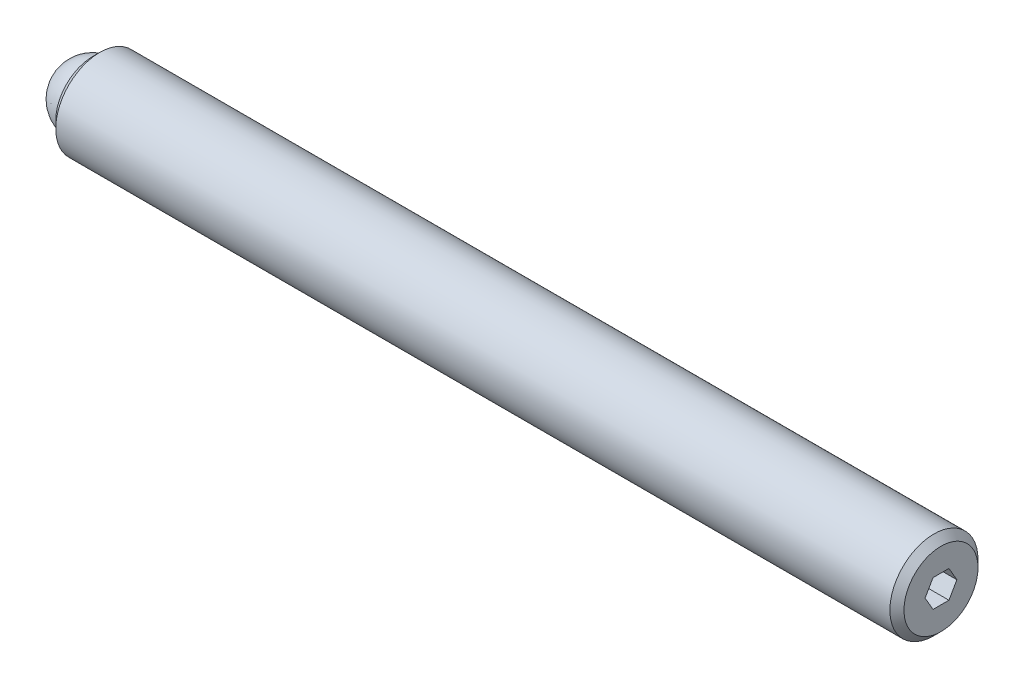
ISO-10303-21;
HEADER;
FILE_DESCRIPTION(('STEP AP214'),'2;1');
FILE_NAME('part.step','',(''),(''),'','','');
FILE_SCHEMA(('AUTOMOTIVE_DESIGN { 1 0 10303 214 1 1 1 1 }'));
ENDSEC;
DATA;
#1=APPLICATION_CONTEXT('core data for automotive mechanical design processes');
#2=APPLICATION_PROTOCOL_DEFINITION('international standard','automotive_design',2000,#1);
#3=PRODUCT_CONTEXT('',#1,'mechanical');
#4=PRODUCT('Part','Part','',(#3));
#5=PRODUCT_RELATED_PRODUCT_CATEGORY('part','',(#4));
#6=PRODUCT_DEFINITION_FORMATION('','',#4);
#7=PRODUCT_DEFINITION_CONTEXT('part definition',#1,'design');
#8=PRODUCT_DEFINITION('design','',#6,#7);
#9=PRODUCT_DEFINITION_SHAPE('','',#8);
#10=(LENGTH_UNIT() NAMED_UNIT(*) SI_UNIT(.MILLI.,.METRE.));
#11=(NAMED_UNIT(*) PLANE_ANGLE_UNIT() SI_UNIT($,.RADIAN.));
#12=(NAMED_UNIT(*) SI_UNIT($,.STERADIAN.) SOLID_ANGLE_UNIT());
#13=UNCERTAINTY_MEASURE_WITH_UNIT(LENGTH_MEASURE(1.E-05),#10,'distance_accuracy_value','');
#14=(GEOMETRIC_REPRESENTATION_CONTEXT(3) GLOBAL_UNCERTAINTY_ASSIGNED_CONTEXT((#13)) GLOBAL_UNIT_ASSIGNED_CONTEXT((#10,
#11,#12)) REPRESENTATION_CONTEXT('',''));
#15=CARTESIAN_POINT('',(0.,0.,0.));
#16=DIRECTION('',(0.,0.,1.));
#17=DIRECTION('',(1.,0.,0.));
#18=AXIS2_PLACEMENT_3D('',#15,#16,#17);
#19=CARTESIAN_POINT('',(0.,0.,0.));
#20=DIRECTION('',(0.,-1.,0.));
#21=DIRECTION('',(0.,0.,1.));
#22=AXIS2_PLACEMENT_3D('',#19,#20,#21);
#23=SPHERICAL_SURFACE('',#22,2.38125);
#24=CARTESIAN_POINT('',(0.,-2.38125,0.));
#25=VERTEX_POINT('',#24);
#26=VERTEX_LOOP('',#25);
#27=FACE_BOUND('',#26,.T.);
#28=ADVANCED_FACE('F43',(#27),#23,.T.);
#29=CLOSED_SHELL('',(#28));
#30=MANIFOLD_SOLID_BREP('B2',#29);
#31=CARTESIAN_POINT('',(61.11875,0.,0.));
#32=DIRECTION('',(-1.,0.,0.));
#33=DIRECTION('',(0.,0.,1.));
#34=AXIS2_PLACEMENT_3D('',#31,#32,#33);
#35=CYLINDRICAL_SURFACE('',#34,3.175);
#36=CARTESIAN_POINT('',(60.61075,0.,0.));
#37=DIRECTION('',(1.,0.,0.));
#38=DIRECTION('',(0.,0.,-1.));
#39=AXIS2_PLACEMENT_3D('',#36,#37,#38);
#40=CIRCLE('',#39,3.175);
#41=CARTESIAN_POINT('',(60.61075,0.,-3.175));
#42=VERTEX_POINT('',#41);
#43=EDGE_CURVE('E41',#42,#42,#40,.F.);
#44=ORIENTED_EDGE('',*,*,#43,.T.);
#45=EDGE_LOOP('',(#44));
#46=FACE_BOUND('',#45,.T.);
#47=CARTESIAN_POINT('',(0.508000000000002,0.,0.));
#48=DIRECTION('',(1.,0.,0.));
#49=DIRECTION('',(0.,0.,-1.));
#50=AXIS2_PLACEMENT_3D('',#47,#48,#49);
#51=CIRCLE('',#50,3.175);
#52=CARTESIAN_POINT('',(0.508000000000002,0.,-3.175));
#53=VERTEX_POINT('',#52);
#54=EDGE_CURVE('E159',#53,#53,#51,.T.);
#55=ORIENTED_EDGE('',*,*,#54,.T.);
#56=EDGE_LOOP('',(#55));
#57=FACE_BOUND('',#56,.T.);
#58=ADVANCED_FACE('F56',(#46,#57),#35,.T.);
#59=CARTESIAN_POINT('',(61.11875,0.,0.));
#60=DIRECTION('',(1.,0.,0.));
#61=DIRECTION('',(0.,0.,-1.));
#62=AXIS2_PLACEMENT_3D('',#59,#60,#61);
#63=PLANE('',#62);
#64=DIRECTION('',(0.,0.866025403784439,-0.5));
#65=VECTOR('',#64,1.);
#66=CARTESIAN_POINT('',(61.11875,-0.9921875,-0.572839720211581));
#67=LINE('',#66,#65);
#68=CARTESIAN_POINT('',(61.11875,-0.9921875,-0.572839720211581));
#69=VERTEX_POINT('',#68);
#70=CARTESIAN_POINT('',(61.11875,0.,-1.14567944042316));
#71=VERTEX_POINT('',#70);
#72=EDGE_CURVE('E71',#69,#71,#67,.T.);
#73=ORIENTED_EDGE('',*,*,#72,.F.);
#74=DIRECTION('',(0.,0.,-1.));
#75=VECTOR('',#74,1.);
#76=CARTESIAN_POINT('',(61.11875,-0.9921875,0.572839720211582));
#77=LINE('',#76,#75);
#78=CARTESIAN_POINT('',(61.11875,-0.9921875,0.572839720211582));
#79=VERTEX_POINT('',#78);
#80=EDGE_CURVE('E155',#79,#69,#77,.T.);
#81=ORIENTED_EDGE('',*,*,#80,.F.);
#82=DIRECTION('',(0.,-0.866025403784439,-0.5));
#83=VECTOR('',#82,1.);
#84=CARTESIAN_POINT('',(61.11875,0.,1.14567944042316));
#85=LINE('',#84,#83);
#86=CARTESIAN_POINT('',(61.11875,0.,1.14567944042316));
#87=VERTEX_POINT('',#86);
#88=EDGE_CURVE('E153',#87,#79,#85,.T.);
#89=ORIENTED_EDGE('',*,*,#88,.F.);
#90=DIRECTION('',(0.,-0.866025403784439,0.5));
#91=VECTOR('',#90,1.);
#92=CARTESIAN_POINT('',(61.11875,0.992187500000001,0.572839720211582));
#93=LINE('',#92,#91);
#94=CARTESIAN_POINT('',(61.11875,0.992187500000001,0.572839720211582));
#95=VERTEX_POINT('',#94);
#96=EDGE_CURVE('E119',#95,#87,#93,.T.);
#97=ORIENTED_EDGE('',*,*,#96,.F.);
#98=DIRECTION('',(0.,0.,1.));
#99=VECTOR('',#98,1.);
#100=CARTESIAN_POINT('',(61.11875,0.9921875,-0.572839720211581));
#101=LINE('',#100,#99);
#102=CARTESIAN_POINT('',(61.11875,0.9921875,-0.572839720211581));
#103=VERTEX_POINT('',#102);
#104=EDGE_CURVE('E149',#103,#95,#101,.T.);
#105=ORIENTED_EDGE('',*,*,#104,.F.);
#106=DIRECTION('',(0.,0.866025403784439,0.5));
#107=VECTOR('',#106,1.);
#108=CARTESIAN_POINT('',(61.11875,0.,-1.14567944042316));
#109=LINE('',#108,#107);
#110=EDGE_CURVE('E145',#71,#103,#109,.T.);
#111=ORIENTED_EDGE('',*,*,#110,.F.);
#112=EDGE_LOOP('',(#73,#81,#89,#97,#105,#111));
#113=FACE_BOUND('',#112,.T.);
#114=CARTESIAN_POINT('',(61.11875,0.,0.));
#115=DIRECTION('',(1.,0.,0.));
#116=DIRECTION('',(0.,0.,-1.));
#117=AXIS2_PLACEMENT_3D('',#114,#115,#116);
#118=CIRCLE('',#117,2.667);
#119=CARTESIAN_POINT('',(61.11875,0.,-2.667));
#120=VERTEX_POINT('',#119);
#121=EDGE_CURVE('E64',#120,#120,#118,.T.);
#122=ORIENTED_EDGE('',*,*,#121,.T.);
#123=EDGE_LOOP('',(#122));
#124=FACE_BOUND('',#123,.T.);
#125=ADVANCED_FACE('F172',(#113,#124),#63,.T.);
#126=CARTESIAN_POINT('',(0.,0.,0.));
#127=DIRECTION('',(1.,0.,0.));
#128=DIRECTION('',(0.,0.,-1.));
#129=AXIS2_PLACEMENT_3D('',#126,#127,#128);
#130=PLANE('',#129);
#131=CARTESIAN_POINT('',(0.,0.,0.));
#132=DIRECTION('',(-1.,0.,0.));
#133=DIRECTION('',(0.,0.,1.));
#134=AXIS2_PLACEMENT_3D('',#131,#132,#133);
#135=CIRCLE('',#134,2.38125);
#136=CARTESIAN_POINT('',(0.,0.,2.38125));
#137=VERTEX_POINT('',#136);
#138=EDGE_CURVE('E227',#137,#137,#135,.T.);
#139=ORIENTED_EDGE('',*,*,#138,.F.);
#140=EDGE_LOOP('',(#139));
#141=FACE_BOUND('',#140,.T.);
#142=CARTESIAN_POINT('',(0.,0.,0.));
#143=DIRECTION('',(1.,0.,0.));
#144=DIRECTION('',(0.,0.,-1.));
#145=AXIS2_PLACEMENT_3D('',#142,#143,#144);
#146=CIRCLE('',#145,2.667);
#147=CARTESIAN_POINT('',(0.,0.,-2.667));
#148=VERTEX_POINT('',#147);
#149=EDGE_CURVE('E167',#148,#148,#146,.F.);
#150=ORIENTED_EDGE('',*,*,#149,.T.);
#151=EDGE_LOOP('',(#150));
#152=FACE_BOUND('',#151,.T.);
#153=ADVANCED_FACE('F184',(#141,#152),#130,.F.);
#154=CARTESIAN_POINT('',(0.508000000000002,0.,0.));
#155=DIRECTION('',(1.,0.,0.));
#156=DIRECTION('',(0.,0.,-1.));
#157=AXIS2_PLACEMENT_3D('',#154,#155,#156);
#158=CONICAL_SURFACE('',#157,3.175,0.78539816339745);
#159=ORIENTED_EDGE('',*,*,#149,.F.);
#160=EDGE_LOOP('',(#159));
#161=FACE_BOUND('',#160,.T.);
#162=ORIENTED_EDGE('',*,*,#54,.F.);
#163=EDGE_LOOP('',(#162));
#164=FACE_BOUND('',#163,.T.);
#165=ADVANCED_FACE('F176',(#161,#164),#158,.T.);
#166=CARTESIAN_POINT('',(61.11875,0.,0.));
#167=DIRECTION('',(-1.,0.,0.));
#168=DIRECTION('',(0.,0.,1.));
#169=AXIS2_PLACEMENT_3D('',#166,#167,#168);
#170=CONICAL_SURFACE('',#169,2.667,0.785398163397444);
#171=ORIENTED_EDGE('',*,*,#43,.F.);
#172=EDGE_LOOP('',(#171));
#173=FACE_BOUND('',#172,.T.);
#174=ORIENTED_EDGE('',*,*,#121,.F.);
#175=EDGE_LOOP('',(#174));
#176=FACE_BOUND('',#175,.T.);
#177=ADVANCED_FACE('F58',(#173,#176),#170,.T.);
#178=CARTESIAN_POINT('',(58.83275,-0.9921875,-0.572839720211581));
#179=DIRECTION('',(0.,-0.5,-0.866025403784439));
#180=DIRECTION('',(0.,0.866025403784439,-0.5));
#181=AXIS2_PLACEMENT_3D('',#178,#179,#180);
#182=PLANE('',#181);
#183=ORIENTED_EDGE('',*,*,#72,.T.);
#184=DIRECTION('',(1.,0.,0.));
#185=VECTOR('',#184,1.);
#186=CARTESIAN_POINT('',(58.83275,0.,-1.14567944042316));
#187=LINE('',#186,#185);
#188=CARTESIAN_POINT('',(58.83275,0.,-1.14567944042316));
#189=VERTEX_POINT('',#188);
#190=EDGE_CURVE('E101',#189,#71,#187,.T.);
#191=ORIENTED_EDGE('',*,*,#190,.F.);
#192=DIRECTION('',(0.,0.866025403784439,-0.5));
#193=VECTOR('',#192,1.);
#194=CARTESIAN_POINT('',(58.83275,-0.9921875,-0.572839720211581));
#195=LINE('',#194,#193);
#196=CARTESIAN_POINT('',(58.83275,-0.9921875,-0.572839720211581));
#197=VERTEX_POINT('',#196);
#198=EDGE_CURVE('E157',#197,#189,#195,.T.);
#199=ORIENTED_EDGE('',*,*,#198,.F.);
#200=DIRECTION('',(1.,0.,0.));
#201=VECTOR('',#200,1.);
#202=CARTESIAN_POINT('',(58.83275,-0.9921875,-0.572839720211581));
#203=LINE('',#202,#201);
#204=EDGE_CURVE('E79',#197,#69,#203,.T.);
#205=ORIENTED_EDGE('',*,*,#204,.T.);
#206=EDGE_LOOP('',(#183,#191,#199,#205));
#207=FACE_BOUND('',#206,.T.);
#208=ADVANCED_FACE('F175',(#207),#182,.F.);
#209=CARTESIAN_POINT('',(58.83275,-0.9921875,0.572839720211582));
#210=DIRECTION('',(0.,-1.,0.));
#211=DIRECTION('',(0.,0.,-1.));
#212=AXIS2_PLACEMENT_3D('',#209,#210,#211);
#213=PLANE('',#212);
#214=ORIENTED_EDGE('',*,*,#80,.T.);
#215=ORIENTED_EDGE('',*,*,#204,.F.);
#216=DIRECTION('',(0.,0.,-1.));
#217=VECTOR('',#216,1.);
#218=CARTESIAN_POINT('',(58.83275,-0.9921875,0.572839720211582));
#219=LINE('',#218,#217);
#220=CARTESIAN_POINT('',(58.83275,-0.9921875,0.572839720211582));
#221=VERTEX_POINT('',#220);
#222=EDGE_CURVE('E131',#221,#197,#219,.T.);
#223=ORIENTED_EDGE('',*,*,#222,.F.);
#224=DIRECTION('',(1.,0.,0.));
#225=VECTOR('',#224,1.);
#226=CARTESIAN_POINT('',(58.83275,-0.9921875,0.572839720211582));
#227=LINE('',#226,#225);
#228=EDGE_CURVE('E123',#221,#79,#227,.T.);
#229=ORIENTED_EDGE('',*,*,#228,.T.);
#230=EDGE_LOOP('',(#214,#215,#223,#229));
#231=FACE_BOUND('',#230,.T.);
#232=ADVANCED_FACE('F182',(#231),#213,.F.);
#233=CARTESIAN_POINT('',(58.83275,0.,1.14567944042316));
#234=DIRECTION('',(0.,-0.5,0.866025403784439));
#235=DIRECTION('',(0.,-0.866025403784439,-0.5));
#236=AXIS2_PLACEMENT_3D('',#233,#234,#235);
#237=PLANE('',#236);
#238=ORIENTED_EDGE('',*,*,#88,.T.);
#239=ORIENTED_EDGE('',*,*,#228,.F.);
#240=DIRECTION('',(0.,-0.866025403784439,-0.5));
#241=VECTOR('',#240,1.);
#242=CARTESIAN_POINT('',(58.83275,0.,1.14567944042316));
#243=LINE('',#242,#241);
#244=CARTESIAN_POINT('',(58.83275,0.,1.14567944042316));
#245=VERTEX_POINT('',#244);
#246=EDGE_CURVE('E127',#245,#221,#243,.T.);
#247=ORIENTED_EDGE('',*,*,#246,.F.);
#248=DIRECTION('',(1.,0.,0.));
#249=VECTOR('',#248,1.);
#250=CARTESIAN_POINT('',(58.83275,0.,1.14567944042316));
#251=LINE('',#250,#249);
#252=EDGE_CURVE('E112',#245,#87,#251,.T.);
#253=ORIENTED_EDGE('',*,*,#252,.T.);
#254=EDGE_LOOP('',(#238,#239,#247,#253));
#255=FACE_BOUND('',#254,.T.);
#256=ADVANCED_FACE('F128',(#255),#237,.F.);
#257=CARTESIAN_POINT('',(58.83275,0.992187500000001,0.572839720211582));
#258=DIRECTION('',(0.,0.5,0.866025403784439));
#259=DIRECTION('',(0.,-0.866025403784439,0.5));
#260=AXIS2_PLACEMENT_3D('',#257,#258,#259);
#261=PLANE('',#260);
#262=ORIENTED_EDGE('',*,*,#96,.T.);
#263=ORIENTED_EDGE('',*,*,#252,.F.);
#264=DIRECTION('',(0.,-0.866025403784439,0.5));
#265=VECTOR('',#264,1.);
#266=CARTESIAN_POINT('',(58.83275,0.992187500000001,0.572839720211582));
#267=LINE('',#266,#265);
#268=CARTESIAN_POINT('',(58.83275,0.992187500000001,0.572839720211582));
#269=VERTEX_POINT('',#268);
#270=EDGE_CURVE('E116',#269,#245,#267,.T.);
#271=ORIENTED_EDGE('',*,*,#270,.F.);
#272=DIRECTION('',(1.,0.,0.));
#273=VECTOR('',#272,1.);
#274=CARTESIAN_POINT('',(58.83275,0.992187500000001,0.572839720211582));
#275=LINE('',#274,#273);
#276=EDGE_CURVE('E124',#269,#95,#275,.T.);
#277=ORIENTED_EDGE('',*,*,#276,.T.);
#278=EDGE_LOOP('',(#262,#263,#271,#277));
#279=FACE_BOUND('',#278,.T.);
#280=ADVANCED_FACE('F114',(#279),#261,.F.);
#281=CARTESIAN_POINT('',(58.83275,0.9921875,-0.572839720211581));
#282=DIRECTION('',(0.,1.,0.));
#283=DIRECTION('',(0.,0.,1.));
#284=AXIS2_PLACEMENT_3D('',#281,#282,#283);
#285=PLANE('',#284);
#286=ORIENTED_EDGE('',*,*,#104,.T.);
#287=ORIENTED_EDGE('',*,*,#276,.F.);
#288=DIRECTION('',(0.,0.,1.));
#289=VECTOR('',#288,1.);
#290=CARTESIAN_POINT('',(58.83275,0.9921875,-0.572839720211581));
#291=LINE('',#290,#289);
#292=CARTESIAN_POINT('',(58.83275,0.9921875,-0.572839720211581));
#293=VERTEX_POINT('',#292);
#294=EDGE_CURVE('E137',#293,#269,#291,.T.);
#295=ORIENTED_EDGE('',*,*,#294,.F.);
#296=DIRECTION('',(1.,0.,0.));
#297=VECTOR('',#296,1.);
#298=CARTESIAN_POINT('',(58.83275,0.9921875,-0.572839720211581));
#299=LINE('',#298,#297);
#300=EDGE_CURVE('E162',#293,#103,#299,.T.);
#301=ORIENTED_EDGE('',*,*,#300,.T.);
#302=EDGE_LOOP('',(#286,#287,#295,#301));
#303=FACE_BOUND('',#302,.T.);
#304=ADVANCED_FACE('F203',(#303),#285,.F.);
#305=CARTESIAN_POINT('',(58.83275,0.,-1.14567944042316));
#306=DIRECTION('',(0.,0.5,-0.866025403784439));
#307=DIRECTION('',(0.,0.866025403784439,0.5));
#308=AXIS2_PLACEMENT_3D('',#305,#306,#307);
#309=PLANE('',#308);
#310=ORIENTED_EDGE('',*,*,#110,.T.);
#311=ORIENTED_EDGE('',*,*,#300,.F.);
#312=DIRECTION('',(0.,0.866025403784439,0.5));
#313=VECTOR('',#312,1.);
#314=CARTESIAN_POINT('',(58.83275,0.,-1.14567944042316));
#315=LINE('',#314,#313);
#316=EDGE_CURVE('E139',#189,#293,#315,.T.);
#317=ORIENTED_EDGE('',*,*,#316,.F.);
#318=ORIENTED_EDGE('',*,*,#190,.T.);
#319=EDGE_LOOP('',(#310,#311,#317,#318));
#320=FACE_BOUND('',#319,.T.);
#321=ADVANCED_FACE('F200',(#320),#309,.F.);
#322=CARTESIAN_POINT('',(58.83275,0.,0.));
#323=DIRECTION('',(1.,0.,0.));
#324=DIRECTION('',(0.,0.,-1.));
#325=AXIS2_PLACEMENT_3D('',#322,#323,#324);
#326=PLANE('',#325);
#327=ORIENTED_EDGE('',*,*,#198,.T.);
#328=ORIENTED_EDGE('',*,*,#316,.T.);
#329=ORIENTED_EDGE('',*,*,#294,.T.);
#330=ORIENTED_EDGE('',*,*,#270,.T.);
#331=ORIENTED_EDGE('',*,*,#246,.T.);
#332=ORIENTED_EDGE('',*,*,#222,.T.);
#333=EDGE_LOOP('',(#327,#328,#329,#330,#331,#332));
#334=FACE_BOUND('',#333,.T.);
#335=ADVANCED_FACE('F134',(#334),#326,.T.);
#336=CARTESIAN_POINT('',(1.984375,0.,0.));
#337=DIRECTION('',(-1.,0.,0.));
#338=DIRECTION('',(0.,0.,1.));
#339=AXIS2_PLACEMENT_3D('',#336,#337,#338);
#340=CYLINDRICAL_SURFACE('',#339,2.38125);
#341=CARTESIAN_POINT('',(1.984375,0.,0.));
#342=DIRECTION('',(-1.,0.,0.));
#343=DIRECTION('',(0.,0.,1.));
#344=AXIS2_PLACEMENT_3D('',#341,#342,#343);
#345=CIRCLE('',#344,2.38125);
#346=CARTESIAN_POINT('',(1.984375,0.,2.38125));
#347=VERTEX_POINT('',#346);
#348=EDGE_CURVE('E146',#347,#347,#345,.T.);
#349=ORIENTED_EDGE('',*,*,#348,.F.);
#350=EDGE_LOOP('',(#349));
#351=FACE_BOUND('',#350,.T.);
#352=ORIENTED_EDGE('',*,*,#138,.T.);
#353=EDGE_LOOP('',(#352));
#354=FACE_BOUND('',#353,.T.);
#355=ADVANCED_FACE('F216',(#351,#354),#340,.F.);
#356=CARTESIAN_POINT('',(1.984375,0.,0.));
#357=DIRECTION('',(-1.,0.,0.));
#358=DIRECTION('',(0.,0.,1.));
#359=AXIS2_PLACEMENT_3D('',#356,#357,#358);
#360=PLANE('',#359);
#361=ORIENTED_EDGE('',*,*,#348,.T.);
#362=EDGE_LOOP('',(#361));
#363=FACE_BOUND('',#362,.T.);
#364=ADVANCED_FACE('F219',(#363),#360,.T.);
#365=CLOSED_SHELL('',(#58,#125,#153,#165,#177,#208,#232,#256,#280,#304,#321,#335,#355,#364));
#366=MANIFOLD_SOLID_BREP('B6',#365);
#367=ADVANCED_BREP_SHAPE_REPRESENTATION('',(#18,#30,#366),#14);
#368=SHAPE_DEFINITION_REPRESENTATION(#9,#367);
ENDSEC;
END-ISO-10303-21;
